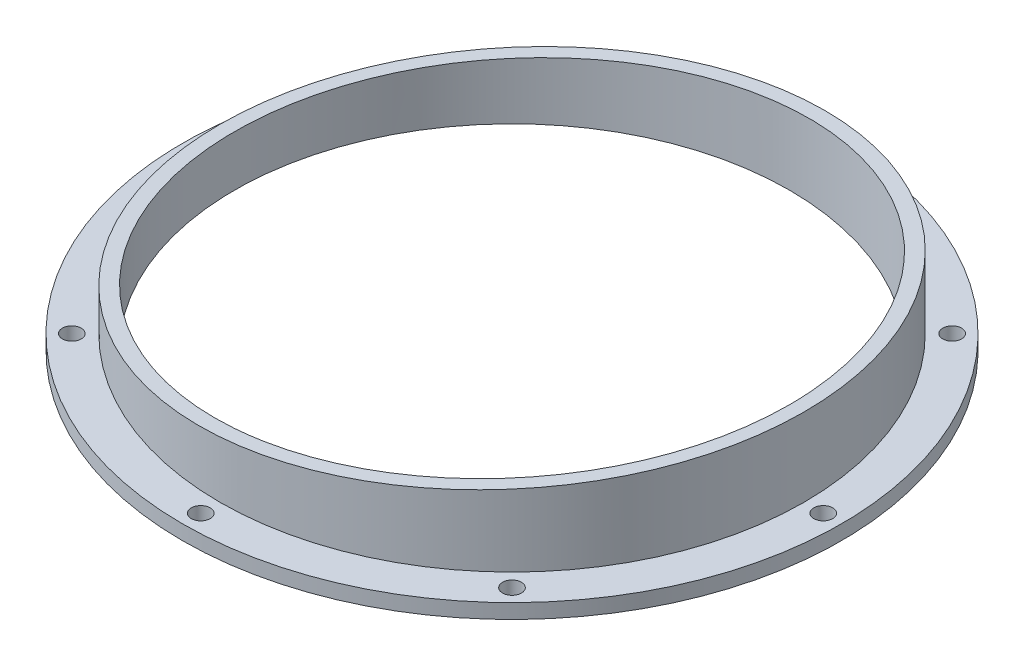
from build123d import *

# Parameters (mm, degrees)
SKETCH1_R                      = 50.673
EXTRUDE1_DEPTH                 = 25.4
SKETCH2_R                      = 57.15
EXTRUDE2_DEPTH                 = 2.54
SKETCH4_R                      = 48.133
EXTRUDE3_DEPTH                 = 86.515429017
EXTRUDE5_DEPTH                 = 85.719566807
EXTRUDE5_DEPTH_BACK            = 85.719566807
F_4_CLEARANCE_HOLE1_AT_2_COUNT = 2
F_4_CLEARANCE_HOLE1_AT_2_PITCH = 10.103694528
F_4_CLEARANCE_HOLE1_AT_3_COUNT = 2
F_4_CLEARANCE_HOLE1_AT_3_PITCH = 11.594845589
CIRPATTERN1_COUNT              = 8


with BuildPart() as part:
    # Sketch1 → Extrude1 (new body)
    with BuildSketch(Plane(origin=(0, 0, 0), x_dir=(1, 0, 0), z_dir=(0, 1, 0))):
        with Locations(Location((0, 0, 0), (0, 0, 270))):
            Circle(SKETCH1_R)
    extrude(amount=EXTRUDE1_DEPTH)

    # Sketch2 → Extrude2 (add)
    with BuildSketch(Plane.XZ):
        with Locations(Location((0, 0, 0), (0, 0, 270))):
            Circle(SKETCH2_R)
    extrude(amount=EXTRUDE2_DEPTH)

    # Sketch4 → Extrude3 (cut, through all)
    with BuildSketch(Plane(origin=(0, 25.4, 0), x_dir=(-1, 0, 0), z_dir=(0, 1, 0))):
        with Locations(Location((0, 0, 0), (0, 0, 90))):
            Circle(SKETCH4_R)
    extrude(amount=-EXTRUDE3_DEPTH, mode=Mode.SUBTRACT)

    # Sketch6 → Extrude5 (cut, two sides: drawn at the far end of the back side and taken through both)
    with BuildSketch(Plane.XY.offset(-EXTRUDE5_DEPTH_BACK)):
        Polygon((279.132748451, 30.463644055), (50.673, 13.566337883), (-50.673, 6.0706), (-279.132748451, -10.826706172), (-312.927360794, 446.09279073), (245.338136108, 487.383140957), align=None)
    extrude(amount=EXTRUDE5_DEPTH + EXTRUDE5_DEPTH_BACK, mode=Mode.SUBTRACT)

    # Sketch8 → 4 Clearance Hole1 (revolve, cut)
    with BuildSketch(Plane(origin=(-53.975, -2.54, 0), x_dir=(0, 0, -1), z_dir=(1, 0, 0))):
        Polygon((0, 0), (0, 10.124574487), (1.63195, 9.144), (1.63195, 0), align=None)
    f_4_clearance_hole1 = revolve(axis=Axis((-53.975, -8.89, 0), (0, 1, 0)), mode=Mode.SUBTRACT)

    # 4 Clearance Hole1 at 2: 4 Clearance Hole1 ×2
    with Locations(*[(i * F_4_CLEARANCE_HOLE1_AT_2_PITCH, 0, 0) for i in range(1, F_4_CLEARANCE_HOLE1_AT_2_COUNT)]):
        add(f_4_clearance_hole1, mode=Mode.SUBTRACT)

    # 4 Clearance Hole1 at 3: 4 Clearance Hole1 ×2
    with Locations(*[(i * F_4_CLEARANCE_HOLE1_AT_3_PITCH, 0, 0) for i in range(1, F_4_CLEARANCE_HOLE1_AT_3_COUNT)]):
        add(f_4_clearance_hole1, mode=Mode.SUBTRACT)

    # CirPattern1: 4 Clearance Hole1 ×8 about axis
    cirpattern1_axis = Axis((0, 0, 0), (0, 1, 0))
    for i in range(1, CIRPATTERN1_COUNT):
        add(f_4_clearance_hole1.rotate(cirpattern1_axis, i * 360 / CIRPATTERN1_COUNT), mode=Mode.SUBTRACT)

    # CirPattern1 copy 1 sketch → CirPattern1 copy 1 (revolve, cut)
    with BuildSketch(Plane(origin=(-31.021697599, -2.54, 31.021697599), x_dir=(-0.7071067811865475, 0, -0.7071067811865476), z_dir=(0.7071067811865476, 0, -0.7071067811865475))):
        Polygon((0, 0), (0, 10.124574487), (1.63195, 9.144), (1.63195, 0), align=None)
    revolve(axis=Axis((-31.021697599, -8.89, 31.021697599), (0, 1, 0)), mode=Mode.SUBTRACT)

    # CirPattern1 copy 2 sketch → CirPattern1 copy 2 (revolve, cut)
    with BuildSketch(Plane(origin=(0, -2.54, 43.871305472), x_dir=(-1, 0, 0), z_dir=(0, 0, -1))):
        Polygon((0, 0), (0, 10.124574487), (1.63195, 9.144), (1.63195, 0), align=None)
    revolve(axis=Axis((0, -8.89, 43.871305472), (0, 1, 0)), mode=Mode.SUBTRACT)

    # CirPattern1 copy 3 sketch → CirPattern1 copy 3 (revolve, cut)
    with BuildSketch(Plane(origin=(31.021697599, -2.54, 31.021697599), x_dir=(-0.7071067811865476, 0, 0.7071067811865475), z_dir=(-0.7071067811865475, 0, -0.7071067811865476))):
        Polygon((0, 0), (0, 10.124574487), (1.63195, 9.144), (1.63195, 0), align=None)
    revolve(axis=Axis((31.021697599, -8.89, 31.021697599), (0, 1, 0)), mode=Mode.SUBTRACT)

    # CirPattern1 copy 4 sketch → CirPattern1 copy 4 (revolve, cut)
    with BuildSketch(Plane(origin=(43.871305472, -2.54, 0), x_dir=(0, 0, 1), z_dir=(-1, 0, 0))):
        Polygon((0, 0), (0, 10.124574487), (1.63195, 9.144), (1.63195, 0), align=None)
    revolve(axis=Axis((43.871305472, -8.89, 0), (0, 1, 0)), mode=Mode.SUBTRACT)

    # CirPattern1 copy 5 sketch → CirPattern1 copy 5 (revolve, cut)
    with BuildSketch(Plane(origin=(31.021697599, -2.54, -31.021697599), x_dir=(0.7071067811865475, 0, 0.7071067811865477), z_dir=(-0.7071067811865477, 0, 0.7071067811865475))):
        Polygon((0, 0), (0, 10.124574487), (1.63195, 9.144), (1.63195, 0), align=None)
    revolve(axis=Axis((31.021697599, -8.89, -31.021697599), (0, 1, 0)), mode=Mode.SUBTRACT)

    # CirPattern1 copy 6 sketch → CirPattern1 copy 6 (revolve, cut)
    with BuildSketch(Plane(origin=(0, -2.54, -43.871305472), x_dir=(1, 0, 0), z_dir=(0, 0, 1))):
        Polygon((0, 0), (0, 10.124574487), (1.63195, 9.144), (1.63195, 0), align=None)
    revolve(axis=Axis((0, -8.89, -43.871305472), (0, 1, 0)), mode=Mode.SUBTRACT)

    # CirPattern1 copy 7 sketch → CirPattern1 copy 7 (revolve, cut)
    with BuildSketch(Plane(origin=(-31.021697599, -2.54, -31.021697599), x_dir=(0.7071067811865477, 0, -0.7071067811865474), z_dir=(0.7071067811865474, 0, 0.7071067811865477))):
        Polygon((0, 0), (0, 10.124574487), (1.63195, 9.144), (1.63195, 0), align=None)
    revolve(axis=Axis((-31.021697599, -8.89, -31.021697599), (0, 1, 0)), mode=Mode.SUBTRACT)

    # CirPattern1 copy 8 sketch → CirPattern1 copy 8 (revolve, cut)
    with BuildSketch(Plane(origin=(-29.967294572, -2.54, 29.967294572), x_dir=(-0.7071067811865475, 0, -0.7071067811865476), z_dir=(0.7071067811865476, 0, -0.7071067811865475))):
        Polygon((0, 0), (0, 10.124574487), (1.63195, 9.144), (1.63195, 0), align=None)
    revolve(axis=Axis((-29.967294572, -8.89, 29.967294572), (0, 1, 0)), mode=Mode.SUBTRACT)

    # CirPattern1 copy 9 sketch → CirPattern1 copy 9 (revolve, cut)
    with BuildSketch(Plane(origin=(0, -2.54, 42.380154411), x_dir=(-1, 0, 0), z_dir=(0, 0, -1))):
        Polygon((0, 0), (0, 10.124574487), (1.63195, 9.144), (1.63195, 0), align=None)
    revolve(axis=Axis((0, -8.89, 42.380154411), (0, 1, 0)), mode=Mode.SUBTRACT)

    # CirPattern1 copy 10 sketch → CirPattern1 copy 10 (revolve, cut)
    with BuildSketch(Plane(origin=(29.967294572, -2.54, 29.967294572), x_dir=(-0.7071067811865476, 0, 0.7071067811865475), z_dir=(-0.7071067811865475, 0, -0.7071067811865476))):
        Polygon((0, 0), (0, 10.124574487), (1.63195, 9.144), (1.63195, 0), align=None)
    revolve(axis=Axis((29.967294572, -8.89, 29.967294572), (0, 1, 0)), mode=Mode.SUBTRACT)

    # CirPattern1 copy 11 sketch → CirPattern1 copy 11 (revolve, cut)
    with BuildSketch(Plane(origin=(42.380154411, -2.54, 0), x_dir=(0, 0, 1), z_dir=(-1, 0, 0))):
        Polygon((0, 0), (0, 10.124574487), (1.63195, 9.144), (1.63195, 0), align=None)
    revolve(axis=Axis((42.380154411, -8.89, 0), (0, 1, 0)), mode=Mode.SUBTRACT)

    # CirPattern1 copy 12 sketch → CirPattern1 copy 12 (revolve, cut)
    with BuildSketch(Plane(origin=(29.967294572, -2.54, -29.967294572), x_dir=(0.7071067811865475, 0, 0.7071067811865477), z_dir=(-0.7071067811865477, 0, 0.7071067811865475))):
        Polygon((0, 0), (0, 10.124574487), (1.63195, 9.144), (1.63195, 0), align=None)
    revolve(axis=Axis((29.967294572, -8.89, -29.967294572), (0, 1, 0)), mode=Mode.SUBTRACT)

    # CirPattern1 copy 13 sketch → CirPattern1 copy 13 (revolve, cut)
    with BuildSketch(Plane(origin=(0, -2.54, -42.380154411), x_dir=(1, 0, 0), z_dir=(0, 0, 1))):
        Polygon((0, 0), (0, 10.124574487), (1.63195, 9.144), (1.63195, 0), align=None)
    revolve(axis=Axis((0, -8.89, -42.380154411), (0, 1, 0)), mode=Mode.SUBTRACT)

    # CirPattern1 copy 14 sketch → CirPattern1 copy 14 (revolve, cut)
    with BuildSketch(Plane(origin=(-29.967294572, -2.54, -29.967294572), x_dir=(0.7071067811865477, 0, -0.7071067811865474), z_dir=(0.7071067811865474, 0, 0.7071067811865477))):
        Polygon((0, 0), (0, 10.124574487), (1.63195, 9.144), (1.63195, 0), align=None)
    revolve(axis=Axis((-29.967294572, -8.89, -29.967294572), (0, 1, 0)), mode=Mode.SUBTRACT)


solid = part.part
